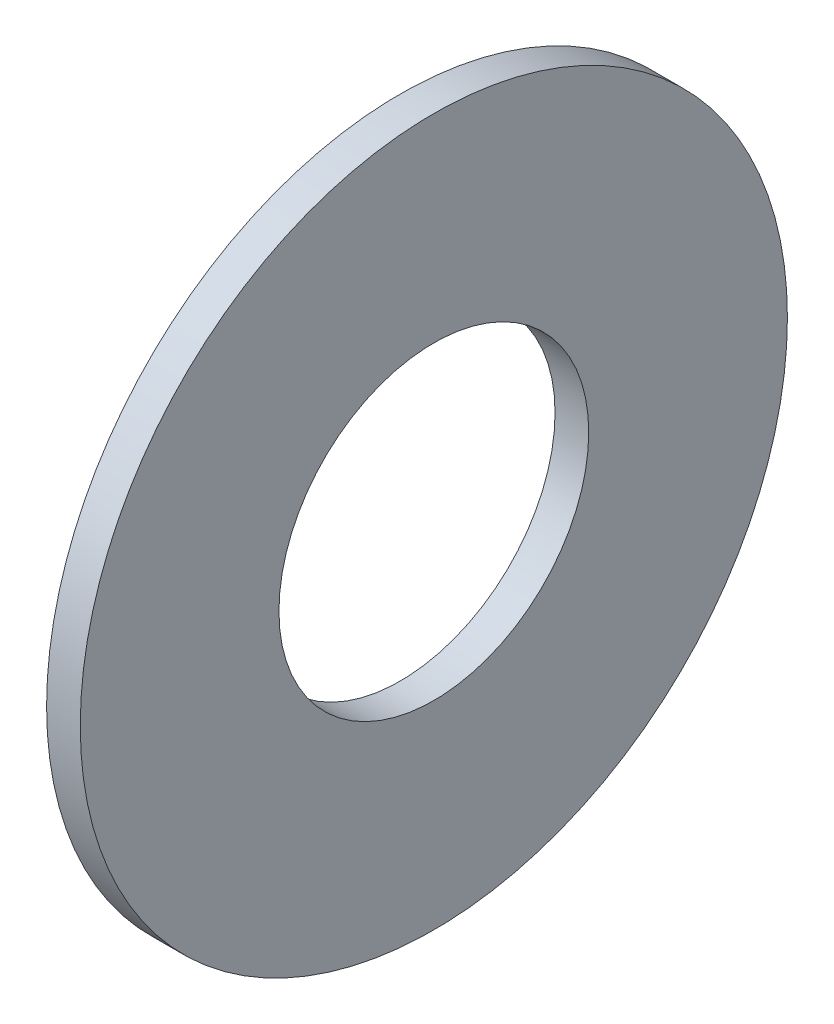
from build123d import *

# Parameters (mm, degrees)
SKETCH1_R          = 10.5
SKETCH1_R_2        = 4.6
BASE_EXTRUDE_DEPTH = 1


with BuildPart() as part:
    # Sketch1 → Base-Extrude (new body)
    with BuildSketch(Plane(origin=(0, 0, 0), x_dir=(0, 0, -1), z_dir=(1, 0, 0))):
        Circle(SKETCH1_R)
        Circle(SKETCH1_R_2, mode=Mode.SUBTRACT)
    extrude(amount=BASE_EXTRUDE_DEPTH)


solid = part.part
